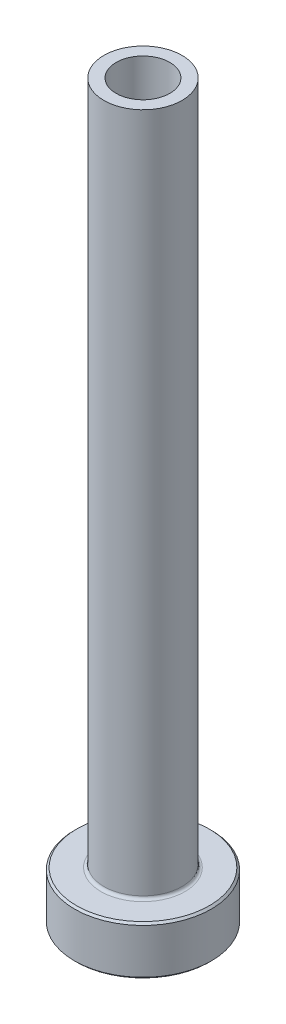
from build123d import *

# Parameters (mm, degrees)
FILLET1_R     = 0.3
CHAMFER1_SIZE = 0.2
CHAMFER3_SIZE = 0.5


with BuildPart() as part:
    # Sketch1 → Revolve1 (revolve)
    with BuildSketch(Plane.XY, mode=Mode.PRIVATE) as revolve1_sk:
        Polygon((-2.75, 75), (-4, 75), (-4, 5), (-7, 5), (-7, 0), (-3, 0), (-3, 18), (-2.75, 30), align=None)
    revolve(revolve1_sk.sketch.rotate(Axis((0, 92.187680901, 0), (0, -1, 0)), 270), axis=Axis((0, 92.187680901, 0), (0, -1, 0)))

    # Fillet1
    fillet1_edges = [part.edges().sort_by_distance(p)[0] for p in [
        (0, 5, -4),
    ]]
    fillet(fillet1_edges, radius=FILLET1_R)

    # Chamfer1
    chamfer1_edges = [part.edges().sort_by_distance(p)[0] for p in [
        (0, 0, -7),
        (0, 5, -7),
    ]]
    chamfer(chamfer1_edges, length=CHAMFER1_SIZE)

    # Chamfer3
    chamfer3_edges = [part.edges().sort_by_distance(p)[0] for p in [
        (0, 0, -3),
    ]]
    chamfer(chamfer3_edges, length=CHAMFER3_SIZE)


solid = part.part
